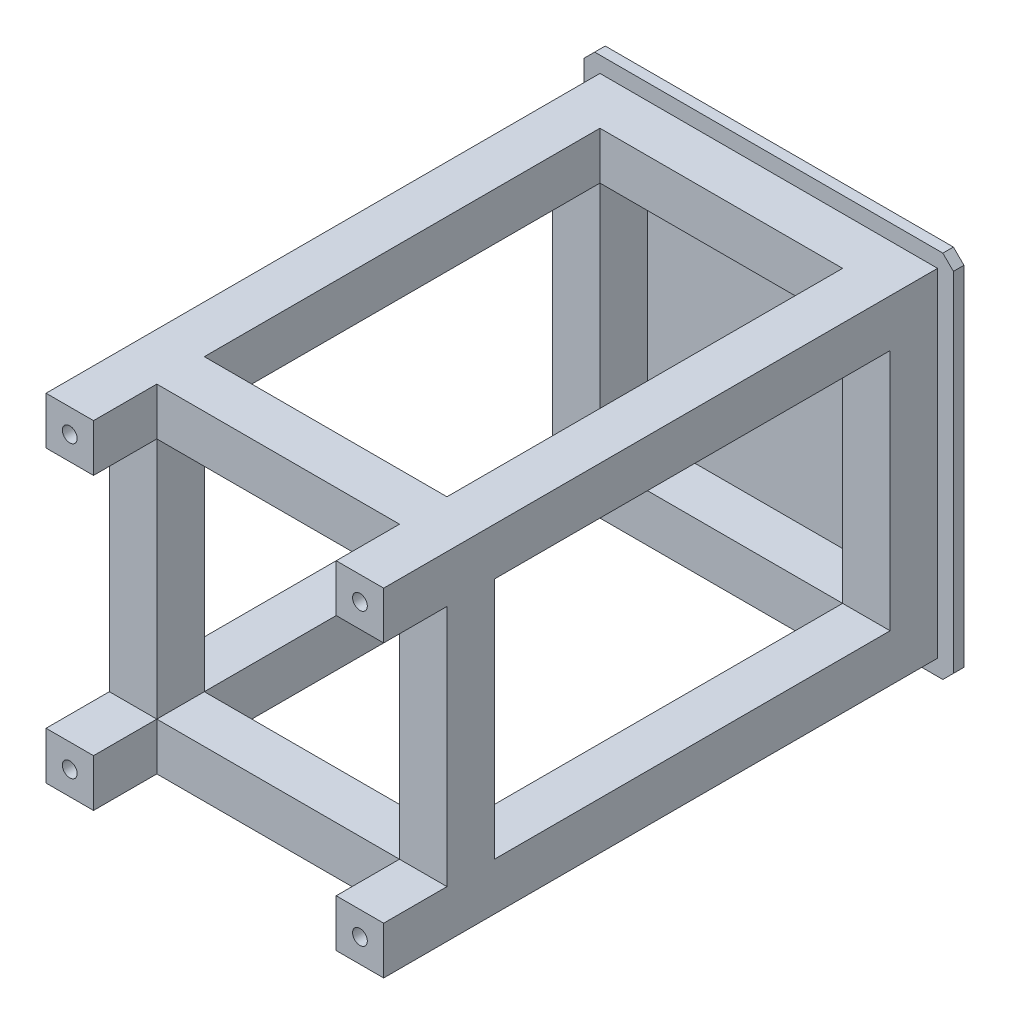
ISO-10303-21;
HEADER;
FILE_DESCRIPTION(('STEP AP214'),'2;1');
FILE_NAME('part.step','',(''),(''),'','','');
FILE_SCHEMA(('AUTOMOTIVE_DESIGN { 1 0 10303 214 1 1 1 1 }'));
ENDSEC;
DATA;
#1=APPLICATION_CONTEXT('core data for automotive mechanical design processes');
#2=APPLICATION_PROTOCOL_DEFINITION('international standard','automotive_design',2000,#1);
#3=PRODUCT_CONTEXT('',#1,'mechanical');
#4=PRODUCT('Part','Part','',(#3));
#5=PRODUCT_RELATED_PRODUCT_CATEGORY('part','',(#4));
#6=PRODUCT_DEFINITION_FORMATION('','',#4);
#7=PRODUCT_DEFINITION_CONTEXT('part definition',#1,'design');
#8=PRODUCT_DEFINITION('design','',#6,#7);
#9=PRODUCT_DEFINITION_SHAPE('','',#8);
#10=(LENGTH_UNIT() NAMED_UNIT(*) SI_UNIT(.MILLI.,.METRE.));
#11=(NAMED_UNIT(*) PLANE_ANGLE_UNIT() SI_UNIT($,.RADIAN.));
#12=(NAMED_UNIT(*) SI_UNIT($,.STERADIAN.) SOLID_ANGLE_UNIT());
#13=UNCERTAINTY_MEASURE_WITH_UNIT(LENGTH_MEASURE(1.E-05),#10,'distance_accuracy_value','');
#14=(GEOMETRIC_REPRESENTATION_CONTEXT(3) GLOBAL_UNCERTAINTY_ASSIGNED_CONTEXT((#13)) GLOBAL_UNIT_ASSIGNED_CONTEXT((#10,
#11,#12)) REPRESENTATION_CONTEXT('',''));
#15=CARTESIAN_POINT('',(0.,0.,0.));
#16=DIRECTION('',(0.,0.,1.));
#17=DIRECTION('',(1.,0.,0.));
#18=AXIS2_PLACEMENT_3D('',#15,#16,#17);
#19=CARTESIAN_POINT('',(-160.,115.,535.));
#20=DIRECTION('',(0.,1.,0.));
#21=DIRECTION('',(-1.,0.,0.));
#22=AXIS2_PLACEMENT_3D('',#19,#20,#21);
#23=PLANE('',#22);
#24=DIRECTION('',(-1.,0.,0.));
#25=VECTOR('',#24,1.);
#26=CARTESIAN_POINT('',(-160.,115.,475.));
#27=LINE('',#26,#25);
#28=CARTESIAN_POINT('',(-115.,115.,475.));
#29=VERTEX_POINT('',#28);
#30=CARTESIAN_POINT('',(-160.,115.,475.));
#31=VERTEX_POINT('',#30);
#32=EDGE_CURVE('E267',#29,#31,#27,.T.);
#33=ORIENTED_EDGE('',*,*,#32,.F.);
#34=DIRECTION('',(0.,0.,-1.));
#35=VECTOR('',#34,1.);
#36=CARTESIAN_POINT('',(-115.,115.,535.));
#37=LINE('',#36,#35);
#38=CARTESIAN_POINT('',(-115.,115.,535.));
#39=VERTEX_POINT('',#38);
#40=EDGE_CURVE('E340',#39,#29,#37,.T.);
#41=ORIENTED_EDGE('',*,*,#40,.F.);
#42=DIRECTION('',(1.,0.,0.));
#43=VECTOR('',#42,1.);
#44=CARTESIAN_POINT('',(-160.,115.,535.));
#45=LINE('',#44,#43);
#46=CARTESIAN_POINT('',(-160.,115.,535.));
#47=VERTEX_POINT('',#46);
#48=EDGE_CURVE('E329',#47,#39,#45,.T.);
#49=ORIENTED_EDGE('',*,*,#48,.F.);
#50=DIRECTION('',(0.,0.,-1.));
#51=VECTOR('',#50,1.);
#52=CARTESIAN_POINT('',(-160.,115.,535.));
#53=LINE('',#52,#51);
#54=EDGE_CURVE('E361',#47,#31,#53,.T.);
#55=ORIENTED_EDGE('',*,*,#54,.T.);
#56=EDGE_LOOP('',(#33,#41,#49,#55));
#57=FACE_BOUND('',#56,.T.);
#58=ADVANCED_FACE('F16',(#57),#23,.F.);
#59=DIRECTION('',(0.,0.,-1.));
#60=VECTOR('',#59,1.);
#61=CARTESIAN_POINT('',(-115.,115.,475.));
#62=LINE('',#61,#60);
#63=CARTESIAN_POINT('',(-115.,115.,430.));
#64=VERTEX_POINT('',#63);
#65=EDGE_CURVE('E550',#29,#64,#62,.T.);
#66=ORIENTED_EDGE('',*,*,#65,.T.);
#67=DIRECTION('',(1.,0.,0.));
#68=VECTOR('',#67,1.);
#69=CARTESIAN_POINT('',(-160.,115.,430.));
#70=LINE('',#69,#68);
#71=CARTESIAN_POINT('',(115.,115.,430.));
#72=VERTEX_POINT('',#71);
#73=EDGE_CURVE('E534',#64,#72,#70,.T.);
#74=ORIENTED_EDGE('',*,*,#73,.T.);
#75=DIRECTION('',(0.,0.,-1.));
#76=VECTOR('',#75,1.);
#77=CARTESIAN_POINT('',(115.,115.,475.));
#78=LINE('',#77,#76);
#79=CARTESIAN_POINT('',(115.,115.,475.));
#80=VERTEX_POINT('',#79);
#81=EDGE_CURVE('E589',#80,#72,#78,.T.);
#82=ORIENTED_EDGE('',*,*,#81,.F.);
#83=DIRECTION('',(1.,0.,0.));
#84=VECTOR('',#83,1.);
#85=CARTESIAN_POINT('',(-160.,115.,475.));
#86=LINE('',#85,#84);
#87=EDGE_CURVE('E613',#29,#80,#86,.T.);
#88=ORIENTED_EDGE('',*,*,#87,.F.);
#89=EDGE_LOOP('',(#66,#74,#82,#88));
#90=FACE_BOUND('',#89,.T.);
#91=ADVANCED_FACE('F478',(#90),#23,.F.);
#92=CARTESIAN_POINT('',(-160.,-115.,535.));
#93=DIRECTION('',(0.,-1.,0.));
#94=DIRECTION('',(1.,0.,0.));
#95=AXIS2_PLACEMENT_3D('',#92,#93,#94);
#96=PLANE('',#95);
#97=DIRECTION('',(1.,0.,0.));
#98=VECTOR('',#97,1.);
#99=CARTESIAN_POINT('',(-160.,-115.,475.));
#100=LINE('',#99,#98);
#101=CARTESIAN_POINT('',(-160.,-115.,475.));
#102=VERTEX_POINT('',#101);
#103=CARTESIAN_POINT('',(-115.,-115.,475.));
#104=VERTEX_POINT('',#103);
#105=EDGE_CURVE('E265',#102,#104,#100,.T.);
#106=ORIENTED_EDGE('',*,*,#105,.F.);
#107=DIRECTION('',(0.,0.,-1.));
#108=VECTOR('',#107,1.);
#109=CARTESIAN_POINT('',(-160.,-115.,535.));
#110=LINE('',#109,#108);
#111=CARTESIAN_POINT('',(-160.,-115.,535.));
#112=VERTEX_POINT('',#111);
#113=EDGE_CURVE('E277',#112,#102,#110,.T.);
#114=ORIENTED_EDGE('',*,*,#113,.F.);
#115=DIRECTION('',(-1.,0.,0.));
#116=VECTOR('',#115,1.);
#117=CARTESIAN_POINT('',(-160.,-115.,535.));
#118=LINE('',#117,#116);
#119=CARTESIAN_POINT('',(-115.,-115.,535.));
#120=VERTEX_POINT('',#119);
#121=EDGE_CURVE('E291',#120,#112,#118,.T.);
#122=ORIENTED_EDGE('',*,*,#121,.F.);
#123=DIRECTION('',(0.,0.,-1.));
#124=VECTOR('',#123,1.);
#125=CARTESIAN_POINT('',(-115.,-115.,535.));
#126=LINE('',#125,#124);
#127=EDGE_CURVE('E280',#120,#104,#126,.T.);
#128=ORIENTED_EDGE('',*,*,#127,.T.);
#129=EDGE_LOOP('',(#106,#114,#122,#128));
#130=FACE_BOUND('',#129,.T.);
#131=ADVANCED_FACE('F275',(#130),#96,.F.);
#132=DIRECTION('',(0.,0.,-1.));
#133=VECTOR('',#132,1.);
#134=CARTESIAN_POINT('',(-115.,-115.,475.));
#135=LINE('',#134,#133);
#136=CARTESIAN_POINT('',(-115.,-115.,430.));
#137=VERTEX_POINT('',#136);
#138=EDGE_CURVE('E552',#104,#137,#135,.T.);
#139=ORIENTED_EDGE('',*,*,#138,.F.);
#140=DIRECTION('',(-1.,0.,0.));
#141=VECTOR('',#140,1.);
#142=CARTESIAN_POINT('',(-160.,-115.,475.));
#143=LINE('',#142,#141);
#144=CARTESIAN_POINT('',(115.,-115.,475.));
#145=VERTEX_POINT('',#144);
#146=EDGE_CURVE('E596',#145,#104,#143,.T.);
#147=ORIENTED_EDGE('',*,*,#146,.F.);
#148=DIRECTION('',(0.,0.,-1.));
#149=VECTOR('',#148,1.);
#150=CARTESIAN_POINT('',(115.,-115.,475.));
#151=LINE('',#150,#149);
#152=CARTESIAN_POINT('',(115.,-115.,430.));
#153=VERTEX_POINT('',#152);
#154=EDGE_CURVE('E577',#145,#153,#151,.T.);
#155=ORIENTED_EDGE('',*,*,#154,.T.);
#156=DIRECTION('',(-1.,0.,0.));
#157=VECTOR('',#156,1.);
#158=CARTESIAN_POINT('',(-160.,-115.,430.));
#159=LINE('',#158,#157);
#160=EDGE_CURVE('E597',#153,#137,#159,.T.);
#161=ORIENTED_EDGE('',*,*,#160,.T.);
#162=EDGE_LOOP('',(#139,#147,#155,#161));
#163=FACE_BOUND('',#162,.T.);
#164=ADVANCED_FACE('F517',(#163),#96,.F.);
#165=DIRECTION('',(-1.,0.,0.));
#166=VECTOR('',#165,1.);
#167=CARTESIAN_POINT('',(160.,115.,475.));
#168=LINE('',#167,#166);
#169=CARTESIAN_POINT('',(160.,115.,475.));
#170=VERTEX_POINT('',#169);
#171=EDGE_CURVE('E570',#170,#80,#168,.T.);
#172=ORIENTED_EDGE('',*,*,#171,.F.);
#173=DIRECTION('',(0.,0.,-1.));
#174=VECTOR('',#173,1.);
#175=CARTESIAN_POINT('',(160.,115.,535.));
#176=LINE('',#175,#174);
#177=CARTESIAN_POINT('',(160.,115.,535.));
#178=VERTEX_POINT('',#177);
#179=EDGE_CURVE('E315',#178,#170,#176,.T.);
#180=ORIENTED_EDGE('',*,*,#179,.F.);
#181=DIRECTION('',(1.,0.,0.));
#182=VECTOR('',#181,1.);
#183=CARTESIAN_POINT('',(160.,115.,535.));
#184=LINE('',#183,#182);
#185=CARTESIAN_POINT('',(115.,115.,535.));
#186=VERTEX_POINT('',#185);
#187=EDGE_CURVE('E308',#186,#178,#184,.T.);
#188=ORIENTED_EDGE('',*,*,#187,.F.);
#189=DIRECTION('',(0.,0.,-1.));
#190=VECTOR('',#189,1.);
#191=CARTESIAN_POINT('',(115.,115.,535.));
#192=LINE('',#191,#190);
#193=EDGE_CURVE('E319',#186,#80,#192,.T.);
#194=ORIENTED_EDGE('',*,*,#193,.T.);
#195=EDGE_LOOP('',(#172,#180,#188,#194));
#196=FACE_BOUND('',#195,.T.);
#197=ADVANCED_FACE('F487',(#196),#23,.F.);
#198=CARTESIAN_POINT('',(-115.,115.,55.));
#199=VERTEX_POINT('',#198);
#200=EDGE_CURVE('E351',#64,#199,#37,.T.);
#201=ORIENTED_EDGE('',*,*,#200,.F.);
#202=DIRECTION('',(-1.,0.,0.));
#203=VECTOR('',#202,1.);
#204=CARTESIAN_POINT('',(-160.,115.,430.));
#205=LINE('',#204,#203);
#206=CARTESIAN_POINT('',(-160.,115.,430.));
#207=VERTEX_POINT('',#206);
#208=EDGE_CURVE('E524',#64,#207,#205,.T.);
#209=ORIENTED_EDGE('',*,*,#208,.T.);
#210=CARTESIAN_POINT('',(-160.,115.,55.));
#211=VERTEX_POINT('',#210);
#212=EDGE_CURVE('E359',#207,#211,#53,.T.);
#213=ORIENTED_EDGE('',*,*,#212,.T.);
#214=DIRECTION('',(1.,0.,0.));
#215=VECTOR('',#214,1.);
#216=CARTESIAN_POINT('',(-160.,115.,55.));
#217=LINE('',#216,#215);
#218=EDGE_CURVE('E325',#211,#199,#217,.T.);
#219=ORIENTED_EDGE('',*,*,#218,.T.);
#220=EDGE_LOOP('',(#201,#209,#213,#219));
#221=FACE_BOUND('',#220,.T.);
#222=ADVANCED_FACE('F494',(#221),#23,.F.);
#223=DIRECTION('',(1.,0.,0.));
#224=VECTOR('',#223,1.);
#225=CARTESIAN_POINT('',(160.,-115.,475.));
#226=LINE('',#225,#224);
#227=CARTESIAN_POINT('',(160.,-115.,475.));
#228=VERTEX_POINT('',#227);
#229=EDGE_CURVE('E575',#145,#228,#226,.T.);
#230=ORIENTED_EDGE('',*,*,#229,.F.);
#231=DIRECTION('',(0.,0.,-1.));
#232=VECTOR('',#231,1.);
#233=CARTESIAN_POINT('',(115.,-115.,535.));
#234=LINE('',#233,#232);
#235=CARTESIAN_POINT('',(115.,-115.,535.));
#236=VERTEX_POINT('',#235);
#237=EDGE_CURVE('E668',#236,#145,#234,.T.);
#238=ORIENTED_EDGE('',*,*,#237,.F.);
#239=DIRECTION('',(-1.,0.,0.));
#240=VECTOR('',#239,1.);
#241=CARTESIAN_POINT('',(115.,-115.,535.));
#242=LINE('',#241,#240);
#243=CARTESIAN_POINT('',(160.,-115.,535.));
#244=VERTEX_POINT('',#243);
#245=EDGE_CURVE('E661',#244,#236,#242,.T.);
#246=ORIENTED_EDGE('',*,*,#245,.F.);
#247=DIRECTION('',(0.,0.,-1.));
#248=VECTOR('',#247,1.);
#249=CARTESIAN_POINT('',(160.,-115.,535.));
#250=LINE('',#249,#248);
#251=EDGE_CURVE('E672',#244,#228,#250,.T.);
#252=ORIENTED_EDGE('',*,*,#251,.T.);
#253=EDGE_LOOP('',(#230,#238,#246,#252));
#254=FACE_BOUND('',#253,.T.);
#255=ADVANCED_FACE('F507',(#254),#96,.F.);
#256=CARTESIAN_POINT('',(-160.,-115.,430.));
#257=VERTEX_POINT('',#256);
#258=CARTESIAN_POINT('',(-160.,-115.,55.));
#259=VERTEX_POINT('',#258);
#260=EDGE_CURVE('E288',#257,#259,#110,.T.);
#261=ORIENTED_EDGE('',*,*,#260,.F.);
#262=DIRECTION('',(1.,0.,0.));
#263=VECTOR('',#262,1.);
#264=CARTESIAN_POINT('',(-160.,-115.,430.));
#265=LINE('',#264,#263);
#266=EDGE_CURVE('E555',#257,#137,#265,.T.);
#267=ORIENTED_EDGE('',*,*,#266,.T.);
#268=CARTESIAN_POINT('',(-115.,-115.,55.));
#269=VERTEX_POINT('',#268);
#270=EDGE_CURVE('E287',#137,#269,#126,.T.);
#271=ORIENTED_EDGE('',*,*,#270,.T.);
#272=DIRECTION('',(-1.,0.,0.));
#273=VECTOR('',#272,1.);
#274=CARTESIAN_POINT('',(-160.,-115.,55.));
#275=LINE('',#274,#273);
#276=EDGE_CURVE('E293',#269,#259,#275,.T.);
#277=ORIENTED_EDGE('',*,*,#276,.T.);
#278=EDGE_LOOP('',(#261,#267,#271,#277));
#279=FACE_BOUND('',#278,.T.);
#280=ADVANCED_FACE('F514',(#279),#96,.F.);
#281=CARTESIAN_POINT('',(-115.,-160.,535.));
#282=DIRECTION('',(-1.,0.,0.));
#283=DIRECTION('',(0.,0.,1.));
#284=AXIS2_PLACEMENT_3D('',#281,#282,#283);
#285=PLANE('',#284);
#286=DIRECTION('',(0.,1.,0.));
#287=VECTOR('',#286,1.);
#288=CARTESIAN_POINT('',(-115.,-160.,430.));
#289=LINE('',#288,#287);
#290=CARTESIAN_POINT('',(-115.,-160.,430.));
#291=VERTEX_POINT('',#290);
#292=EDGE_CURVE('E543',#291,#137,#289,.T.);
#293=ORIENTED_EDGE('',*,*,#292,.F.);
#294=DIRECTION('',(0.,0.,-1.));
#295=VECTOR('',#294,1.);
#296=CARTESIAN_POINT('',(-115.,-160.,535.));
#297=LINE('',#296,#295);
#298=CARTESIAN_POINT('',(-115.,-160.,55.));
#299=VERTEX_POINT('',#298);
#300=EDGE_CURVE('E296',#291,#299,#297,.T.);
#301=ORIENTED_EDGE('',*,*,#300,.T.);
#302=DIRECTION('',(0.,1.,0.));
#303=VECTOR('',#302,1.);
#304=CARTESIAN_POINT('',(-115.,-160.,55.));
#305=LINE('',#304,#303);
#306=EDGE_CURVE('E679',#299,#269,#305,.T.);
#307=ORIENTED_EDGE('',*,*,#306,.T.);
#308=ORIENTED_EDGE('',*,*,#270,.F.);
#309=EDGE_LOOP('',(#293,#301,#307,#308));
#310=FACE_BOUND('',#309,.T.);
#311=ADVANCED_FACE('F792',(#310),#285,.F.);
#312=CARTESIAN_POINT('',(115.,-115.,535.));
#313=DIRECTION('',(1.,0.,0.));
#314=DIRECTION('',(0.,0.,-1.));
#315=AXIS2_PLACEMENT_3D('',#312,#313,#314);
#316=PLANE('',#315);
#317=DIRECTION('',(0.,-1.,0.));
#318=VECTOR('',#317,1.);
#319=CARTESIAN_POINT('',(115.,-115.,430.));
#320=LINE('',#319,#318);
#321=CARTESIAN_POINT('',(115.,-160.,430.));
#322=VERTEX_POINT('',#321);
#323=EDGE_CURVE('E608',#153,#322,#320,.T.);
#324=ORIENTED_EDGE('',*,*,#323,.F.);
#325=CARTESIAN_POINT('',(115.,-115.,55.));
#326=VERTEX_POINT('',#325);
#327=EDGE_CURVE('E663',#153,#326,#234,.T.);
#328=ORIENTED_EDGE('',*,*,#327,.T.);
#329=DIRECTION('',(0.,-1.,0.));
#330=VECTOR('',#329,1.);
#331=CARTESIAN_POINT('',(115.,-115.,55.));
#332=LINE('',#331,#330);
#333=CARTESIAN_POINT('',(115.,-160.,55.));
#334=VERTEX_POINT('',#333);
#335=EDGE_CURVE('E651',#326,#334,#332,.T.);
#336=ORIENTED_EDGE('',*,*,#335,.T.);
#337=DIRECTION('',(0.,0.,-1.));
#338=VECTOR('',#337,1.);
#339=CARTESIAN_POINT('',(115.,-160.,535.));
#340=LINE('',#339,#338);
#341=EDGE_CURVE('E675',#322,#334,#340,.T.);
#342=ORIENTED_EDGE('',*,*,#341,.F.);
#343=EDGE_LOOP('',(#324,#328,#336,#342));
#344=FACE_BOUND('',#343,.T.);
#345=ADVANCED_FACE('F795',(#344),#316,.F.);
#346=CARTESIAN_POINT('',(-115.,160.,535.));
#347=DIRECTION('',(-1.,0.,0.));
#348=DIRECTION('',(0.,-1.,0.));
#349=AXIS2_PLACEMENT_3D('',#346,#347,#348);
#350=PLANE('',#349);
#351=DIRECTION('',(0.,1.,0.));
#352=VECTOR('',#351,1.);
#353=CARTESIAN_POINT('',(-115.,160.,430.));
#354=LINE('',#353,#352);
#355=CARTESIAN_POINT('',(-115.,160.,430.));
#356=VERTEX_POINT('',#355);
#357=EDGE_CURVE('E538',#64,#356,#354,.T.);
#358=ORIENTED_EDGE('',*,*,#357,.F.);
#359=ORIENTED_EDGE('',*,*,#200,.T.);
#360=DIRECTION('',(0.,1.,0.));
#361=VECTOR('',#360,1.);
#362=CARTESIAN_POINT('',(-115.,160.,55.));
#363=LINE('',#362,#361);
#364=CARTESIAN_POINT('',(-115.,160.,55.));
#365=VERTEX_POINT('',#364);
#366=EDGE_CURVE('E330',#199,#365,#363,.T.);
#367=ORIENTED_EDGE('',*,*,#366,.T.);
#368=DIRECTION('',(0.,0.,-1.));
#369=VECTOR('',#368,1.);
#370=CARTESIAN_POINT('',(-115.,160.,535.));
#371=LINE('',#370,#369);
#372=EDGE_CURVE('E337',#356,#365,#371,.T.);
#373=ORIENTED_EDGE('',*,*,#372,.F.);
#374=EDGE_LOOP('',(#358,#359,#367,#373));
#375=FACE_BOUND('',#374,.T.);
#376=ADVANCED_FACE('F502',(#375),#350,.F.);
#377=CARTESIAN_POINT('',(115.,160.,535.));
#378=DIRECTION('',(1.,0.,0.));
#379=DIRECTION('',(0.,1.,0.));
#380=AXIS2_PLACEMENT_3D('',#377,#378,#379);
#381=PLANE('',#380);
#382=DIRECTION('',(0.,-1.,0.));
#383=VECTOR('',#382,1.);
#384=CARTESIAN_POINT('',(115.,160.,430.));
#385=LINE('',#384,#383);
#386=CARTESIAN_POINT('',(115.,160.,430.));
#387=VERTEX_POINT('',#386);
#388=EDGE_CURVE('E540',#387,#72,#385,.T.);
#389=ORIENTED_EDGE('',*,*,#388,.F.);
#390=DIRECTION('',(0.,0.,-1.));
#391=VECTOR('',#390,1.);
#392=CARTESIAN_POINT('',(115.,160.,535.));
#393=LINE('',#392,#391);
#394=CARTESIAN_POINT('',(115.,160.,55.));
#395=VERTEX_POINT('',#394);
#396=EDGE_CURVE('E322',#387,#395,#393,.T.);
#397=ORIENTED_EDGE('',*,*,#396,.T.);
#398=DIRECTION('',(0.,-1.,0.));
#399=VECTOR('',#398,1.);
#400=CARTESIAN_POINT('',(115.,160.,55.));
#401=LINE('',#400,#399);
#402=CARTESIAN_POINT('',(115.,115.,55.));
#403=VERTEX_POINT('',#402);
#404=EDGE_CURVE('E299',#395,#403,#401,.T.);
#405=ORIENTED_EDGE('',*,*,#404,.T.);
#406=EDGE_CURVE('E318',#72,#403,#192,.T.);
#407=ORIENTED_EDGE('',*,*,#406,.F.);
#408=EDGE_LOOP('',(#389,#397,#405,#407));
#409=FACE_BOUND('',#408,.T.);
#410=ADVANCED_FACE('F929',(#409),#381,.F.);
#411=CARTESIAN_POINT('',(0.,0.,55.));
#412=DIRECTION('',(0.,0.,1.));
#413=DIRECTION('',(1.,0.,0.));
#414=AXIS2_PLACEMENT_3D('',#411,#412,#413);
#415=PLANE('',#414);
#416=DIRECTION('',(1.,0.,0.));
#417=VECTOR('',#416,1.);
#418=CARTESIAN_POINT('',(-160.,-160.,55.));
#419=LINE('',#418,#417);
#420=EDGE_CURVE('E724',#299,#334,#419,.T.);
#421=ORIENTED_EDGE('',*,*,#420,.T.);
#422=ORIENTED_EDGE('',*,*,#335,.F.);
#423=DIRECTION('',(-1.,0.,0.));
#424=VECTOR('',#423,1.);
#425=CARTESIAN_POINT('',(-160.,-115.,55.));
#426=LINE('',#425,#424);
#427=EDGE_CURVE('E713',#326,#269,#426,.T.);
#428=ORIENTED_EDGE('',*,*,#427,.T.);
#429=ORIENTED_EDGE('',*,*,#306,.F.);
#430=EDGE_LOOP('',(#421,#422,#428,#429));
#431=FACE_BOUND('',#430,.T.);
#432=ADVANCED_FACE('F721',(#431),#415,.T.);
#433=DIRECTION('',(0.,-1.,0.));
#434=VECTOR('',#433,1.);
#435=CARTESIAN_POINT('',(115.,115.,55.));
#436=LINE('',#435,#434);
#437=EDGE_CURVE('E741',#403,#326,#436,.T.);
#438=ORIENTED_EDGE('',*,*,#437,.T.);
#439=DIRECTION('',(-1.,0.,0.));
#440=VECTOR('',#439,1.);
#441=CARTESIAN_POINT('',(115.,-115.,55.));
#442=LINE('',#441,#440);
#443=CARTESIAN_POINT('',(160.,-115.,55.));
#444=VERTEX_POINT('',#443);
#445=EDGE_CURVE('E656',#444,#326,#442,.T.);
#446=ORIENTED_EDGE('',*,*,#445,.F.);
#447=DIRECTION('',(0.,1.,0.));
#448=VECTOR('',#447,1.);
#449=CARTESIAN_POINT('',(160.,160.,55.));
#450=LINE('',#449,#448);
#451=CARTESIAN_POINT('',(160.,115.,55.));
#452=VERTEX_POINT('',#451);
#453=EDGE_CURVE('E428',#444,#452,#450,.T.);
#454=ORIENTED_EDGE('',*,*,#453,.T.);
#455=DIRECTION('',(1.,0.,0.));
#456=VECTOR('',#455,1.);
#457=CARTESIAN_POINT('',(160.,115.,55.));
#458=LINE('',#457,#456);
#459=EDGE_CURVE('E304',#403,#452,#458,.T.);
#460=ORIENTED_EDGE('',*,*,#459,.F.);
#461=EDGE_LOOP('',(#438,#446,#454,#460));
#462=FACE_BOUND('',#461,.T.);
#463=ADVANCED_FACE('F804',(#462),#415,.T.);
#464=DIRECTION('',(0.,-1.,0.));
#465=VECTOR('',#464,1.);
#466=CARTESIAN_POINT('',(-160.,160.,55.));
#467=LINE('',#466,#465);
#468=EDGE_CURVE('E414',#211,#259,#467,.T.);
#469=ORIENTED_EDGE('',*,*,#468,.T.);
#470=ORIENTED_EDGE('',*,*,#276,.F.);
#471=DIRECTION('',(0.,1.,0.));
#472=VECTOR('',#471,1.);
#473=CARTESIAN_POINT('',(-115.,115.,55.));
#474=LINE('',#473,#472);
#475=EDGE_CURVE('E697',#269,#199,#474,.T.);
#476=ORIENTED_EDGE('',*,*,#475,.T.);
#477=ORIENTED_EDGE('',*,*,#218,.F.);
#478=EDGE_LOOP('',(#469,#470,#476,#477));
#479=FACE_BOUND('',#478,.T.);
#480=ADVANCED_FACE('F696',(#479),#415,.T.);
#481=DIRECTION('',(1.,0.,0.));
#482=VECTOR('',#481,1.);
#483=CARTESIAN_POINT('',(-160.,115.,55.));
#484=LINE('',#483,#482);
#485=EDGE_CURVE('E418',#199,#403,#484,.T.);
#486=ORIENTED_EDGE('',*,*,#485,.T.);
#487=ORIENTED_EDGE('',*,*,#404,.F.);
#488=DIRECTION('',(-1.,0.,0.));
#489=VECTOR('',#488,1.);
#490=CARTESIAN_POINT('',(-160.,160.,55.));
#491=LINE('',#490,#489);
#492=EDGE_CURVE('E354',#395,#365,#491,.T.);
#493=ORIENTED_EDGE('',*,*,#492,.T.);
#494=ORIENTED_EDGE('',*,*,#366,.F.);
#495=EDGE_LOOP('',(#486,#487,#493,#494));
#496=FACE_BOUND('',#495,.T.);
#497=ADVANCED_FACE('F812',(#496),#415,.T.);
#498=CARTESIAN_POINT('',(0.,0.,10.));
#499=DIRECTION('',(0.,0.,1.));
#500=DIRECTION('',(1.,0.,0.));
#501=AXIS2_PLACEMENT_3D('',#498,#499,#500);
#502=PLANE('',#501);
#503=DIRECTION('',(0.,1.,0.));
#504=VECTOR('',#503,1.);
#505=CARTESIAN_POINT('',(175.,175.,10.));
#506=LINE('',#505,#504);
#507=CARTESIAN_POINT('',(175.,-165.,10.));
#508=VERTEX_POINT('',#507);
#509=CARTESIAN_POINT('',(175.,165.,10.));
#510=VERTEX_POINT('',#509);
#511=EDGE_CURVE('E404',#508,#510,#506,.T.);
#512=ORIENTED_EDGE('',*,*,#511,.T.);
#513=DIRECTION('',(0.707106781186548,-0.707106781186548,0.));
#514=VECTOR('',#513,1.);
#515=CARTESIAN_POINT('',(170.,170.,10.));
#516=LINE('',#515,#514);
#517=CARTESIAN_POINT('',(165.,175.,10.));
#518=VERTEX_POINT('',#517);
#519=EDGE_CURVE('E386',#510,#518,#516,.F.);
#520=ORIENTED_EDGE('',*,*,#519,.T.);
#521=DIRECTION('',(-1.,0.,0.));
#522=VECTOR('',#521,1.);
#523=CARTESIAN_POINT('',(-175.,175.,10.));
#524=LINE('',#523,#522);
#525=CARTESIAN_POINT('',(-165.,175.,10.));
#526=VERTEX_POINT('',#525);
#527=EDGE_CURVE('E408',#518,#526,#524,.T.);
#528=ORIENTED_EDGE('',*,*,#527,.T.);
#529=DIRECTION('',(0.707106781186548,0.707106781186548,0.));
#530=VECTOR('',#529,1.);
#531=CARTESIAN_POINT('',(-170.,170.,10.));
#532=LINE('',#531,#530);
#533=CARTESIAN_POINT('',(-175.,165.,10.));
#534=VERTEX_POINT('',#533);
#535=EDGE_CURVE('E384',#526,#534,#532,.F.);
#536=ORIENTED_EDGE('',*,*,#535,.T.);
#537=DIRECTION('',(0.,-1.,0.));
#538=VECTOR('',#537,1.);
#539=CARTESIAN_POINT('',(-175.,175.,10.));
#540=LINE('',#539,#538);
#541=CARTESIAN_POINT('',(-175.,-165.,10.));
#542=VERTEX_POINT('',#541);
#543=EDGE_CURVE('E449',#534,#542,#540,.T.);
#544=ORIENTED_EDGE('',*,*,#543,.T.);
#545=DIRECTION('',(-0.707106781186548,0.707106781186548,0.));
#546=VECTOR('',#545,1.);
#547=CARTESIAN_POINT('',(-170.,-170.,10.));
#548=LINE('',#547,#546);
#549=CARTESIAN_POINT('',(-165.,-175.,10.));
#550=VERTEX_POINT('',#549);
#551=EDGE_CURVE('E36',#542,#550,#548,.F.);
#552=ORIENTED_EDGE('',*,*,#551,.T.);
#553=DIRECTION('',(1.,0.,0.));
#554=VECTOR('',#553,1.);
#555=CARTESIAN_POINT('',(-175.,-175.,10.));
#556=LINE('',#555,#554);
#557=CARTESIAN_POINT('',(165.,-175.,10.));
#558=VERTEX_POINT('',#557);
#559=EDGE_CURVE('E365',#550,#558,#556,.T.);
#560=ORIENTED_EDGE('',*,*,#559,.T.);
#561=DIRECTION('',(-0.707106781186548,-0.707106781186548,0.));
#562=VECTOR('',#561,1.);
#563=CARTESIAN_POINT('',(170.,-170.,10.));
#564=LINE('',#563,#562);
#565=EDGE_CURVE('E382',#558,#508,#564,.F.);
#566=ORIENTED_EDGE('',*,*,#565,.T.);
#567=EDGE_LOOP('',(#512,#520,#528,#536,#544,#552,#560,#566));
#568=FACE_BOUND('',#567,.T.);
#569=DIRECTION('',(1.,0.,0.));
#570=VECTOR('',#569,1.);
#571=CARTESIAN_POINT('',(-160.,-160.,10.));
#572=LINE('',#571,#570);
#573=CARTESIAN_POINT('',(-160.,-160.,10.));
#574=VERTEX_POINT('',#573);
#575=CARTESIAN_POINT('',(160.,-160.,10.));
#576=VERTEX_POINT('',#575);
#577=EDGE_CURVE('E729',#574,#576,#572,.T.);
#578=ORIENTED_EDGE('',*,*,#577,.F.);
#579=DIRECTION('',(0.,-1.,0.));
#580=VECTOR('',#579,1.);
#581=CARTESIAN_POINT('',(-160.,160.,10.));
#582=LINE('',#581,#580);
#583=CARTESIAN_POINT('',(-160.,160.,10.));
#584=VERTEX_POINT('',#583);
#585=EDGE_CURVE('E432',#584,#574,#582,.T.);
#586=ORIENTED_EDGE('',*,*,#585,.F.);
#587=DIRECTION('',(-1.,0.,0.));
#588=VECTOR('',#587,1.);
#589=CARTESIAN_POINT('',(-160.,160.,10.));
#590=LINE('',#589,#588);
#591=CARTESIAN_POINT('',(160.,160.,10.));
#592=VERTEX_POINT('',#591);
#593=EDGE_CURVE('E419',#592,#584,#590,.T.);
#594=ORIENTED_EDGE('',*,*,#593,.F.);
#595=DIRECTION('',(0.,1.,0.));
#596=VECTOR('',#595,1.);
#597=CARTESIAN_POINT('',(160.,160.,10.));
#598=LINE('',#597,#596);
#599=EDGE_CURVE('E437',#576,#592,#598,.T.);
#600=ORIENTED_EDGE('',*,*,#599,.F.);
#601=EDGE_LOOP('',(#578,#586,#594,#600));
#602=FACE_BOUND('',#601,.T.);
#603=ADVANCED_FACE('F464',(#568,#602),#502,.T.);
#604=DIRECTION('',(1.,0.,0.));
#605=VECTOR('',#604,1.);
#606=CARTESIAN_POINT('',(-160.,115.,10.));
#607=LINE('',#606,#605);
#608=CARTESIAN_POINT('',(-115.,115.,10.));
#609=VERTEX_POINT('',#608);
#610=CARTESIAN_POINT('',(115.,115.,10.));
#611=VERTEX_POINT('',#610);
#612=EDGE_CURVE('E435',#609,#611,#607,.T.);
#613=ORIENTED_EDGE('',*,*,#612,.F.);
#614=DIRECTION('',(0.,1.,0.));
#615=VECTOR('',#614,1.);
#616=CARTESIAN_POINT('',(-115.,115.,10.));
#617=LINE('',#616,#615);
#618=CARTESIAN_POINT('',(-115.,-115.,10.));
#619=VERTEX_POINT('',#618);
#620=EDGE_CURVE('E706',#619,#609,#617,.T.);
#621=ORIENTED_EDGE('',*,*,#620,.F.);
#622=DIRECTION('',(-1.,0.,0.));
#623=VECTOR('',#622,1.);
#624=CARTESIAN_POINT('',(-160.,-115.,10.));
#625=LINE('',#624,#623);
#626=CARTESIAN_POINT('',(115.,-115.,10.));
#627=VERTEX_POINT('',#626);
#628=EDGE_CURVE('E715',#627,#619,#625,.T.);
#629=ORIENTED_EDGE('',*,*,#628,.F.);
#630=DIRECTION('',(0.,-1.,0.));
#631=VECTOR('',#630,1.);
#632=CARTESIAN_POINT('',(115.,115.,10.));
#633=LINE('',#632,#631);
#634=EDGE_CURVE('E716',#611,#627,#633,.T.);
#635=ORIENTED_EDGE('',*,*,#634,.F.);
#636=EDGE_LOOP('',(#613,#621,#629,#635));
#637=FACE_BOUND('',#636,.T.);
#638=ADVANCED_FACE('F819',(#637),#502,.T.);
#639=CARTESIAN_POINT('',(-160.,115.,55.));
#640=DIRECTION('',(0.,1.,0.));
#641=DIRECTION('',(0.,0.,1.));
#642=AXIS2_PLACEMENT_3D('',#639,#640,#641);
#643=PLANE('',#642);
#644=DIRECTION('',(0.,0.,-1.));
#645=VECTOR('',#644,1.);
#646=CARTESIAN_POINT('',(-115.,115.,55.));
#647=LINE('',#646,#645);
#648=EDGE_CURVE('E705',#199,#609,#647,.T.);
#649=ORIENTED_EDGE('',*,*,#648,.T.);
#650=ORIENTED_EDGE('',*,*,#612,.T.);
#651=DIRECTION('',(0.,0.,-1.));
#652=VECTOR('',#651,1.);
#653=CARTESIAN_POINT('',(115.,115.,55.));
#654=LINE('',#653,#652);
#655=EDGE_CURVE('E732',#403,#611,#654,.T.);
#656=ORIENTED_EDGE('',*,*,#655,.F.);
#657=ORIENTED_EDGE('',*,*,#485,.F.);
#658=EDGE_LOOP('',(#649,#650,#656,#657));
#659=FACE_BOUND('',#658,.T.);
#660=ADVANCED_FACE('F816',(#659),#643,.F.);
#661=CARTESIAN_POINT('',(-160.,-115.,55.));
#662=DIRECTION('',(0.,-1.,0.));
#663=DIRECTION('',(0.,0.,-1.));
#664=AXIS2_PLACEMENT_3D('',#661,#662,#663);
#665=PLANE('',#664);
#666=DIRECTION('',(0.,0.,-1.));
#667=VECTOR('',#666,1.);
#668=CARTESIAN_POINT('',(-115.,-115.,55.));
#669=LINE('',#668,#667);
#670=EDGE_CURVE('E702',#269,#619,#669,.T.);
#671=ORIENTED_EDGE('',*,*,#670,.F.);
#672=ORIENTED_EDGE('',*,*,#427,.F.);
#673=DIRECTION('',(0.,0.,-1.));
#674=VECTOR('',#673,1.);
#675=CARTESIAN_POINT('',(115.,-115.,55.));
#676=LINE('',#675,#674);
#677=EDGE_CURVE('E736',#326,#627,#676,.T.);
#678=ORIENTED_EDGE('',*,*,#677,.T.);
#679=ORIENTED_EDGE('',*,*,#628,.T.);
#680=EDGE_LOOP('',(#671,#672,#678,#679));
#681=FACE_BOUND('',#680,.T.);
#682=ADVANCED_FACE('F711',(#681),#665,.F.);
#683=CARTESIAN_POINT('',(175.,175.,10.));
#684=DIRECTION('',(-1.,0.,0.));
#685=DIRECTION('',(0.,-1.,0.));
#686=AXIS2_PLACEMENT_3D('',#683,#684,#685);
#687=PLANE('',#686);
#688=DIRECTION('',(0.,1.,0.));
#689=VECTOR('',#688,1.);
#690=CARTESIAN_POINT('',(175.,175.,0.));
#691=LINE('',#690,#689);
#692=CARTESIAN_POINT('',(175.,-165.,0.));
#693=VERTEX_POINT('',#692);
#694=CARTESIAN_POINT('',(175.,165.,0.));
#695=VERTEX_POINT('',#694);
#696=EDGE_CURVE('E445',#693,#695,#691,.T.);
#697=ORIENTED_EDGE('',*,*,#696,.T.);
#698=DIRECTION('',(0.,0.,1.));
#699=VECTOR('',#698,1.);
#700=CARTESIAN_POINT('',(175.,165.,10.));
#701=LINE('',#700,#699);
#702=EDGE_CURVE('E379',#695,#510,#701,.T.);
#703=ORIENTED_EDGE('',*,*,#702,.T.);
#704=ORIENTED_EDGE('',*,*,#511,.F.);
#705=DIRECTION('',(0.,0.,-1.));
#706=VECTOR('',#705,1.);
#707=CARTESIAN_POINT('',(175.,-165.,10.));
#708=LINE('',#707,#706);
#709=EDGE_CURVE('E376',#508,#693,#708,.T.);
#710=ORIENTED_EDGE('',*,*,#709,.T.);
#711=EDGE_LOOP('',(#697,#703,#704,#710));
#712=FACE_BOUND('',#711,.T.);
#713=ADVANCED_FACE('F838',(#712),#687,.F.);
#714=CARTESIAN_POINT('',(-175.,175.,10.));
#715=DIRECTION('',(0.,-1.,0.));
#716=DIRECTION('',(0.,0.,-1.));
#717=AXIS2_PLACEMENT_3D('',#714,#715,#716);
#718=PLANE('',#717);
#719=ORIENTED_EDGE('',*,*,#527,.F.);
#720=DIRECTION('',(0.,0.,-1.));
#721=VECTOR('',#720,1.);
#722=CARTESIAN_POINT('',(165.,175.,10.));
#723=LINE('',#722,#721);
#724=CARTESIAN_POINT('',(165.,175.,0.));
#725=VERTEX_POINT('',#724);
#726=EDGE_CURVE('E364',#518,#725,#723,.T.);
#727=ORIENTED_EDGE('',*,*,#726,.T.);
#728=DIRECTION('',(-1.,0.,0.));
#729=VECTOR('',#728,1.);
#730=CARTESIAN_POINT('',(-175.,175.,0.));
#731=LINE('',#730,#729);
#732=CARTESIAN_POINT('',(-165.,175.,0.));
#733=VERTEX_POINT('',#732);
#734=EDGE_CURVE('E410',#725,#733,#731,.T.);
#735=ORIENTED_EDGE('',*,*,#734,.T.);
#736=DIRECTION('',(0.,0.,1.));
#737=VECTOR('',#736,1.);
#738=CARTESIAN_POINT('',(-165.,175.,10.));
#739=LINE('',#738,#737);
#740=EDGE_CURVE('E362',#733,#526,#739,.T.);
#741=ORIENTED_EDGE('',*,*,#740,.T.);
#742=EDGE_LOOP('',(#719,#727,#735,#741));
#743=FACE_BOUND('',#742,.T.);
#744=ADVANCED_FACE('F457',(#743),#718,.F.);
#745=CARTESIAN_POINT('',(-175.,175.,10.));
#746=DIRECTION('',(1.,0.,0.));
#747=DIRECTION('',(0.,1.,0.));
#748=AXIS2_PLACEMENT_3D('',#745,#746,#747);
#749=PLANE('',#748);
#750=ORIENTED_EDGE('',*,*,#543,.F.);
#751=DIRECTION('',(0.,0.,-1.));
#752=VECTOR('',#751,1.);
#753=CARTESIAN_POINT('',(-175.,165.,10.));
#754=LINE('',#753,#752);
#755=CARTESIAN_POINT('',(-175.,165.,0.));
#756=VERTEX_POINT('',#755);
#757=EDGE_CURVE('E390',#534,#756,#754,.T.);
#758=ORIENTED_EDGE('',*,*,#757,.T.);
#759=DIRECTION('',(0.,-1.,0.));
#760=VECTOR('',#759,1.);
#761=CARTESIAN_POINT('',(-175.,175.,0.));
#762=LINE('',#761,#760);
#763=CARTESIAN_POINT('',(-175.,-165.,0.));
#764=VERTEX_POINT('',#763);
#765=EDGE_CURVE('E405',#756,#764,#762,.T.);
#766=ORIENTED_EDGE('',*,*,#765,.T.);
#767=DIRECTION('',(0.,0.,1.));
#768=VECTOR('',#767,1.);
#769=CARTESIAN_POINT('',(-175.,-165.,10.));
#770=LINE('',#769,#768);
#771=EDGE_CURVE('E388',#764,#542,#770,.T.);
#772=ORIENTED_EDGE('',*,*,#771,.T.);
#773=EDGE_LOOP('',(#750,#758,#766,#772));
#774=FACE_BOUND('',#773,.T.);
#775=ADVANCED_FACE('F467',(#774),#749,.F.);
#776=CARTESIAN_POINT('',(-175.,-175.,10.));
#777=DIRECTION('',(0.,1.,0.));
#778=DIRECTION('',(0.,0.,1.));
#779=AXIS2_PLACEMENT_3D('',#776,#777,#778);
#780=PLANE('',#779);
#781=DIRECTION('',(1.,0.,0.));
#782=VECTOR('',#781,1.);
#783=CARTESIAN_POINT('',(-175.,-175.,0.));
#784=LINE('',#783,#782);
#785=CARTESIAN_POINT('',(-165.,-175.,0.));
#786=VERTEX_POINT('',#785);
#787=CARTESIAN_POINT('',(165.,-175.,0.));
#788=VERTEX_POINT('',#787);
#789=EDGE_CURVE('E396',#786,#788,#784,.T.);
#790=ORIENTED_EDGE('',*,*,#789,.T.);
#791=DIRECTION('',(0.,0.,1.));
#792=VECTOR('',#791,1.);
#793=CARTESIAN_POINT('',(165.,-175.,10.));
#794=LINE('',#793,#792);
#795=EDGE_CURVE('E11',#788,#558,#794,.T.);
#796=ORIENTED_EDGE('',*,*,#795,.T.);
#797=ORIENTED_EDGE('',*,*,#559,.F.);
#798=DIRECTION('',(0.,0.,-1.));
#799=VECTOR('',#798,1.);
#800=CARTESIAN_POINT('',(-165.,-175.,10.));
#801=LINE('',#800,#799);
#802=EDGE_CURVE('E24',#550,#786,#801,.T.);
#803=ORIENTED_EDGE('',*,*,#802,.T.);
#804=EDGE_LOOP('',(#790,#796,#797,#803));
#805=FACE_BOUND('',#804,.T.);
#806=ADVANCED_FACE('F395',(#805),#780,.F.);
#807=CARTESIAN_POINT('',(0.,0.,0.));
#808=DIRECTION('',(0.,0.,1.));
#809=DIRECTION('',(1.,0.,0.));
#810=AXIS2_PLACEMENT_3D('',#807,#808,#809);
#811=PLANE('',#810);
#812=ORIENTED_EDGE('',*,*,#734,.F.);
#813=DIRECTION('',(-0.707106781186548,0.707106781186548,0.));
#814=VECTOR('',#813,1.);
#815=CARTESIAN_POINT('',(165.,175.,0.));
#816=LINE('',#815,#814);
#817=EDGE_CURVE('E374',#725,#695,#816,.F.);
#818=ORIENTED_EDGE('',*,*,#817,.T.);
#819=ORIENTED_EDGE('',*,*,#696,.F.);
#820=DIRECTION('',(0.707106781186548,0.707106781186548,0.));
#821=VECTOR('',#820,1.);
#822=CARTESIAN_POINT('',(175.,-165.,0.));
#823=LINE('',#822,#821);
#824=EDGE_CURVE('E370',#693,#788,#823,.F.);
#825=ORIENTED_EDGE('',*,*,#824,.T.);
#826=ORIENTED_EDGE('',*,*,#789,.F.);
#827=DIRECTION('',(0.707106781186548,-0.707106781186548,0.));
#828=VECTOR('',#827,1.);
#829=CARTESIAN_POINT('',(-165.,-175.,0.));
#830=LINE('',#829,#828);
#831=EDGE_CURVE('E368',#786,#764,#830,.F.);
#832=ORIENTED_EDGE('',*,*,#831,.T.);
#833=ORIENTED_EDGE('',*,*,#765,.F.);
#834=DIRECTION('',(-0.707106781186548,-0.707106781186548,0.));
#835=VECTOR('',#834,1.);
#836=CARTESIAN_POINT('',(-175.,165.,0.));
#837=LINE('',#836,#835);
#838=EDGE_CURVE('E372',#756,#733,#837,.F.);
#839=ORIENTED_EDGE('',*,*,#838,.T.);
#840=EDGE_LOOP('',(#812,#818,#819,#825,#826,#832,#833,#839));
#841=FACE_BOUND('',#840,.T.);
#842=ADVANCED_FACE('F400',(#841),#811,.F.);
#843=CARTESIAN_POINT('',(-160.,160.,55.));
#844=DIRECTION('',(1.,0.,0.));
#845=DIRECTION('',(0.,0.,-1.));
#846=AXIS2_PLACEMENT_3D('',#843,#844,#845);
#847=PLANE('',#846);
#848=ORIENTED_EDGE('',*,*,#212,.F.);
#849=DIRECTION('',(0.,-1.,0.));
#850=VECTOR('',#849,1.);
#851=CARTESIAN_POINT('',(-160.,115.,430.));
#852=LINE('',#851,#850);
#853=EDGE_CURVE('E559',#207,#257,#852,.T.);
#854=ORIENTED_EDGE('',*,*,#853,.T.);
#855=ORIENTED_EDGE('',*,*,#260,.T.);
#856=ORIENTED_EDGE('',*,*,#468,.F.);
#857=EDGE_LOOP('',(#848,#854,#855,#856));
#858=FACE_BOUND('',#857,.T.);
#859=ORIENTED_EDGE('',*,*,#113,.T.);
#860=DIRECTION('',(0.,-1.,0.));
#861=VECTOR('',#860,1.);
#862=CARTESIAN_POINT('',(-160.,115.,475.));
#863=LINE('',#862,#861);
#864=EDGE_CURVE('E261',#31,#102,#863,.T.);
#865=ORIENTED_EDGE('',*,*,#864,.F.);
#866=ORIENTED_EDGE('',*,*,#54,.F.);
#867=DIRECTION('',(0.,-1.,0.));
#868=VECTOR('',#867,1.);
#869=CARTESIAN_POINT('',(-160.,160.,535.));
#870=LINE('',#869,#868);
#871=CARTESIAN_POINT('',(-160.,160.,535.));
#872=VERTEX_POINT('',#871);
#873=EDGE_CURVE('E326',#872,#47,#870,.T.);
#874=ORIENTED_EDGE('',*,*,#873,.F.);
#875=DIRECTION('',(0.,0.,-1.));
#876=VECTOR('',#875,1.);
#877=CARTESIAN_POINT('',(-160.,160.,55.));
#878=LINE('',#877,#876);
#879=EDGE_CURVE('E442',#872,#584,#878,.T.);
#880=ORIENTED_EDGE('',*,*,#879,.T.);
#881=ORIENTED_EDGE('',*,*,#585,.T.);
#882=DIRECTION('',(0.,0.,-1.));
#883=VECTOR('',#882,1.);
#884=CARTESIAN_POINT('',(-160.,-160.,55.));
#885=LINE('',#884,#883);
#886=CARTESIAN_POINT('',(-160.,-160.,535.));
#887=VERTEX_POINT('',#886);
#888=EDGE_CURVE('E723',#887,#574,#885,.T.);
#889=ORIENTED_EDGE('',*,*,#888,.F.);
#890=DIRECTION('',(0.,-1.,0.));
#891=VECTOR('',#890,1.);
#892=CARTESIAN_POINT('',(-160.,-160.,535.));
#893=LINE('',#892,#891);
#894=EDGE_CURVE('E286',#112,#887,#893,.T.);
#895=ORIENTED_EDGE('',*,*,#894,.F.);
#896=EDGE_LOOP('',(#859,#865,#866,#874,#880,#881,#889,#895));
#897=FACE_BOUND('',#896,.T.);
#898=ADVANCED_FACE('F284',(#858,#897),#847,.F.);
#899=CARTESIAN_POINT('',(160.,160.,55.));
#900=DIRECTION('',(-1.,0.,0.));
#901=DIRECTION('',(0.,0.,1.));
#902=AXIS2_PLACEMENT_3D('',#899,#900,#901);
#903=PLANE('',#902);
#904=DIRECTION('',(0.,1.,0.));
#905=VECTOR('',#904,1.);
#906=CARTESIAN_POINT('',(160.,115.,430.));
#907=LINE('',#906,#905);
#908=CARTESIAN_POINT('',(160.,-115.,430.));
#909=VERTEX_POINT('',#908);
#910=CARTESIAN_POINT('',(160.,115.,430.));
#911=VERTEX_POINT('',#910);
#912=EDGE_CURVE('E567',#909,#911,#907,.T.);
#913=ORIENTED_EDGE('',*,*,#912,.T.);
#914=EDGE_CURVE('E310',#911,#452,#176,.T.);
#915=ORIENTED_EDGE('',*,*,#914,.T.);
#916=ORIENTED_EDGE('',*,*,#453,.F.);
#917=EDGE_CURVE('E671',#909,#444,#250,.T.);
#918=ORIENTED_EDGE('',*,*,#917,.F.);
#919=EDGE_LOOP('',(#913,#915,#916,#918));
#920=FACE_BOUND('',#919,.T.);
#921=DIRECTION('',(0.,0.,-1.));
#922=VECTOR('',#921,1.);
#923=CARTESIAN_POINT('',(160.,-160.,55.));
#924=LINE('',#923,#922);
#925=CARTESIAN_POINT('',(160.,-160.,535.));
#926=VERTEX_POINT('',#925);
#927=EDGE_CURVE('E424',#926,#576,#924,.T.);
#928=ORIENTED_EDGE('',*,*,#927,.T.);
#929=ORIENTED_EDGE('',*,*,#599,.T.);
#930=DIRECTION('',(0.,0.,-1.));
#931=VECTOR('',#930,1.);
#932=CARTESIAN_POINT('',(160.,160.,55.));
#933=LINE('',#932,#931);
#934=CARTESIAN_POINT('',(160.,160.,535.));
#935=VERTEX_POINT('',#934);
#936=EDGE_CURVE('E444',#935,#592,#933,.T.);
#937=ORIENTED_EDGE('',*,*,#936,.F.);
#938=DIRECTION('',(0.,1.,0.));
#939=VECTOR('',#938,1.);
#940=CARTESIAN_POINT('',(160.,160.,535.));
#941=LINE('',#940,#939);
#942=EDGE_CURVE('E300',#178,#935,#941,.T.);
#943=ORIENTED_EDGE('',*,*,#942,.F.);
#944=ORIENTED_EDGE('',*,*,#179,.T.);
#945=DIRECTION('',(0.,1.,0.));
#946=VECTOR('',#945,1.);
#947=CARTESIAN_POINT('',(160.,115.,475.));
#948=LINE('',#947,#946);
#949=EDGE_CURVE('E568',#228,#170,#948,.T.);
#950=ORIENTED_EDGE('',*,*,#949,.F.);
#951=ORIENTED_EDGE('',*,*,#251,.F.);
#952=DIRECTION('',(0.,1.,0.));
#953=VECTOR('',#952,1.);
#954=CARTESIAN_POINT('',(160.,-115.,535.));
#955=LINE('',#954,#953);
#956=EDGE_CURVE('E659',#926,#244,#955,.T.);
#957=ORIENTED_EDGE('',*,*,#956,.F.);
#958=EDGE_LOOP('',(#928,#929,#937,#943,#944,#950,#951,#957));
#959=FACE_BOUND('',#958,.T.);
#960=ADVANCED_FACE('F807',(#920,#959),#903,.F.);
#961=CARTESIAN_POINT('',(-160.,160.,55.));
#962=DIRECTION('',(0.,-1.,0.));
#963=DIRECTION('',(1.,0.,0.));
#964=AXIS2_PLACEMENT_3D('',#961,#962,#963);
#965=PLANE('',#964);
#966=CARTESIAN_POINT('',(-115.,160.,535.));
#967=VERTEX_POINT('',#966);
#968=CARTESIAN_POINT('',(-115.,160.,475.));
#969=VERTEX_POINT('',#968);
#970=EDGE_CURVE('E348',#967,#969,#371,.T.);
#971=ORIENTED_EDGE('',*,*,#970,.T.);
#972=DIRECTION('',(-1.,0.,0.));
#973=VECTOR('',#972,1.);
#974=CARTESIAN_POINT('',(-160.,160.,475.));
#975=LINE('',#974,#973);
#976=CARTESIAN_POINT('',(115.,160.,475.));
#977=VERTEX_POINT('',#976);
#978=EDGE_CURVE('E616',#977,#969,#975,.T.);
#979=ORIENTED_EDGE('',*,*,#978,.F.);
#980=CARTESIAN_POINT('',(115.,160.,535.));
#981=VERTEX_POINT('',#980);
#982=EDGE_CURVE('E323',#981,#977,#393,.T.);
#983=ORIENTED_EDGE('',*,*,#982,.F.);
#984=DIRECTION('',(-1.,0.,0.));
#985=VECTOR('',#984,1.);
#986=CARTESIAN_POINT('',(160.,160.,535.));
#987=LINE('',#986,#985);
#988=EDGE_CURVE('E303',#935,#981,#987,.T.);
#989=ORIENTED_EDGE('',*,*,#988,.F.);
#990=ORIENTED_EDGE('',*,*,#936,.T.);
#991=ORIENTED_EDGE('',*,*,#593,.T.);
#992=ORIENTED_EDGE('',*,*,#879,.F.);
#993=DIRECTION('',(-1.,0.,0.));
#994=VECTOR('',#993,1.);
#995=CARTESIAN_POINT('',(-160.,160.,535.));
#996=LINE('',#995,#994);
#997=EDGE_CURVE('E334',#967,#872,#996,.T.);
#998=ORIENTED_EDGE('',*,*,#997,.F.);
#999=EDGE_LOOP('',(#971,#979,#983,#989,#990,#991,#992,#998));
#1000=FACE_BOUND('',#999,.T.);
#1001=ORIENTED_EDGE('',*,*,#396,.F.);
#1002=DIRECTION('',(-1.,0.,0.));
#1003=VECTOR('',#1002,1.);
#1004=CARTESIAN_POINT('',(-160.,160.,430.));
#1005=LINE('',#1004,#1003);
#1006=EDGE_CURVE('E542',#387,#356,#1005,.T.);
#1007=ORIENTED_EDGE('',*,*,#1006,.T.);
#1008=ORIENTED_EDGE('',*,*,#372,.T.);
#1009=ORIENTED_EDGE('',*,*,#492,.F.);
#1010=EDGE_LOOP('',(#1001,#1007,#1008,#1009));
#1011=FACE_BOUND('',#1010,.T.);
#1012=ADVANCED_FACE('F757',(#1000,#1011),#965,.F.);
#1013=CARTESIAN_POINT('',(-160.,-160.,55.));
#1014=DIRECTION('',(0.,1.,0.));
#1015=DIRECTION('',(-1.,0.,0.));
#1016=AXIS2_PLACEMENT_3D('',#1013,#1014,#1015);
#1017=PLANE('',#1016);
#1018=CARTESIAN_POINT('',(115.,-160.,535.));
#1019=VERTEX_POINT('',#1018);
#1020=CARTESIAN_POINT('',(115.,-160.,475.));
#1021=VERTEX_POINT('',#1020);
#1022=EDGE_CURVE('E676',#1019,#1021,#340,.T.);
#1023=ORIENTED_EDGE('',*,*,#1022,.T.);
#1024=DIRECTION('',(1.,0.,0.));
#1025=VECTOR('',#1024,1.);
#1026=CARTESIAN_POINT('',(-160.,-160.,475.));
#1027=LINE('',#1026,#1025);
#1028=CARTESIAN_POINT('',(-115.,-160.,475.));
#1029=VERTEX_POINT('',#1028);
#1030=EDGE_CURVE('E593',#1029,#1021,#1027,.T.);
#1031=ORIENTED_EDGE('',*,*,#1030,.F.);
#1032=CARTESIAN_POINT('',(-115.,-160.,535.));
#1033=VERTEX_POINT('',#1032);
#1034=EDGE_CURVE('E297',#1033,#1029,#297,.T.);
#1035=ORIENTED_EDGE('',*,*,#1034,.F.);
#1036=DIRECTION('',(1.,0.,0.));
#1037=VECTOR('',#1036,1.);
#1038=CARTESIAN_POINT('',(-160.,-160.,535.));
#1039=LINE('',#1038,#1037);
#1040=EDGE_CURVE('E681',#887,#1033,#1039,.T.);
#1041=ORIENTED_EDGE('',*,*,#1040,.F.);
#1042=ORIENTED_EDGE('',*,*,#888,.T.);
#1043=ORIENTED_EDGE('',*,*,#577,.T.);
#1044=ORIENTED_EDGE('',*,*,#927,.F.);
#1045=DIRECTION('',(1.,0.,0.));
#1046=VECTOR('',#1045,1.);
#1047=CARTESIAN_POINT('',(115.,-160.,535.));
#1048=LINE('',#1047,#1046);
#1049=EDGE_CURVE('E655',#1019,#926,#1048,.T.);
#1050=ORIENTED_EDGE('',*,*,#1049,.F.);
#1051=EDGE_LOOP('',(#1023,#1031,#1035,#1041,#1042,#1043,#1044,#1050));
#1052=FACE_BOUND('',#1051,.T.);
#1053=ORIENTED_EDGE('',*,*,#300,.F.);
#1054=DIRECTION('',(1.,0.,0.));
#1055=VECTOR('',#1054,1.);
#1056=CARTESIAN_POINT('',(-160.,-160.,430.));
#1057=LINE('',#1056,#1055);
#1058=EDGE_CURVE('E592',#291,#322,#1057,.T.);
#1059=ORIENTED_EDGE('',*,*,#1058,.T.);
#1060=ORIENTED_EDGE('',*,*,#341,.T.);
#1061=ORIENTED_EDGE('',*,*,#420,.F.);
#1062=EDGE_LOOP('',(#1053,#1059,#1060,#1061));
#1063=FACE_BOUND('',#1062,.T.);
#1064=ADVANCED_FACE('F766',(#1052,#1063),#1017,.F.);
#1065=CARTESIAN_POINT('',(115.,115.,55.));
#1066=DIRECTION('',(1.,0.,0.));
#1067=DIRECTION('',(0.,1.,0.));
#1068=AXIS2_PLACEMENT_3D('',#1065,#1066,#1067);
#1069=PLANE('',#1068);
#1070=ORIENTED_EDGE('',*,*,#634,.T.);
#1071=ORIENTED_EDGE('',*,*,#677,.F.);
#1072=ORIENTED_EDGE('',*,*,#437,.F.);
#1073=ORIENTED_EDGE('',*,*,#655,.T.);
#1074=EDGE_LOOP('',(#1070,#1071,#1072,#1073));
#1075=FACE_BOUND('',#1074,.T.);
#1076=ADVANCED_FACE('F503',(#1075),#1069,.F.);
#1077=CARTESIAN_POINT('',(-115.,115.,55.));
#1078=DIRECTION('',(-1.,0.,0.));
#1079=DIRECTION('',(0.,0.,1.));
#1080=AXIS2_PLACEMENT_3D('',#1077,#1078,#1079);
#1081=PLANE('',#1080);
#1082=ORIENTED_EDGE('',*,*,#620,.T.);
#1083=ORIENTED_EDGE('',*,*,#648,.F.);
#1084=ORIENTED_EDGE('',*,*,#475,.F.);
#1085=ORIENTED_EDGE('',*,*,#670,.T.);
#1086=EDGE_LOOP('',(#1082,#1083,#1084,#1085));
#1087=FACE_BOUND('',#1086,.T.);
#1088=ADVANCED_FACE('F492',(#1087),#1081,.F.);
#1089=ORIENTED_EDGE('',*,*,#914,.F.);
#1090=DIRECTION('',(-1.,0.,0.));
#1091=VECTOR('',#1090,1.);
#1092=CARTESIAN_POINT('',(160.,115.,430.));
#1093=LINE('',#1092,#1091);
#1094=EDGE_CURVE('E580',#911,#72,#1093,.T.);
#1095=ORIENTED_EDGE('',*,*,#1094,.T.);
#1096=ORIENTED_EDGE('',*,*,#406,.T.);
#1097=ORIENTED_EDGE('',*,*,#459,.T.);
#1098=EDGE_LOOP('',(#1089,#1095,#1096,#1097));
#1099=FACE_BOUND('',#1098,.T.);
#1100=ADVANCED_FACE('F481',(#1099),#23,.F.);
#1101=ORIENTED_EDGE('',*,*,#40,.T.);
#1102=DIRECTION('',(0.,1.,0.));
#1103=VECTOR('',#1102,1.);
#1104=CARTESIAN_POINT('',(-115.,160.,475.));
#1105=LINE('',#1104,#1103);
#1106=EDGE_CURVE('E623',#29,#969,#1105,.T.);
#1107=ORIENTED_EDGE('',*,*,#1106,.T.);
#1108=ORIENTED_EDGE('',*,*,#970,.F.);
#1109=DIRECTION('',(0.,1.,0.));
#1110=VECTOR('',#1109,1.);
#1111=CARTESIAN_POINT('',(-115.,160.,535.));
#1112=LINE('',#1111,#1110);
#1113=EDGE_CURVE('E332',#39,#967,#1112,.T.);
#1114=ORIENTED_EDGE('',*,*,#1113,.F.);
#1115=EDGE_LOOP('',(#1101,#1107,#1108,#1114));
#1116=FACE_BOUND('',#1115,.T.);
#1117=ADVANCED_FACE('F491',(#1116),#350,.F.);
#1118=CARTESIAN_POINT('',(0.,0.,535.));
#1119=DIRECTION('',(0.,0.,1.));
#1120=DIRECTION('',(1.,0.,0.));
#1121=AXIS2_PLACEMENT_3D('',#1118,#1119,#1120);
#1122=PLANE('',#1121);
#1123=CARTESIAN_POINT('',(-137.5,137.5,535.));
#1124=DIRECTION('',(0.,0.,1.));
#1125=DIRECTION('',(1.,0.,0.));
#1126=AXIS2_PLACEMENT_3D('',#1123,#1124,#1125);
#1127=CIRCLE('',#1126,7.);
#1128=CARTESIAN_POINT('',(-130.5,137.5,535.));
#1129=VERTEX_POINT('',#1128);
#1130=EDGE_CURVE('E627',#1129,#1129,#1127,.T.);
#1131=ORIENTED_EDGE('',*,*,#1130,.F.);
#1132=EDGE_LOOP('',(#1131));
#1133=FACE_BOUND('',#1132,.T.);
#1134=ORIENTED_EDGE('',*,*,#873,.T.);
#1135=ORIENTED_EDGE('',*,*,#48,.T.);
#1136=ORIENTED_EDGE('',*,*,#1113,.T.);
#1137=ORIENTED_EDGE('',*,*,#997,.T.);
#1138=EDGE_LOOP('',(#1134,#1135,#1136,#1137));
#1139=FACE_BOUND('',#1138,.T.);
#1140=ADVANCED_FACE('F500',(#1133,#1139),#1122,.T.);
#1141=ORIENTED_EDGE('',*,*,#982,.T.);
#1142=DIRECTION('',(0.,-1.,0.));
#1143=VECTOR('',#1142,1.);
#1144=CARTESIAN_POINT('',(115.,160.,475.));
#1145=LINE('',#1144,#1143);
#1146=EDGE_CURVE('E618',#977,#80,#1145,.T.);
#1147=ORIENTED_EDGE('',*,*,#1146,.T.);
#1148=ORIENTED_EDGE('',*,*,#193,.F.);
#1149=DIRECTION('',(0.,-1.,0.));
#1150=VECTOR('',#1149,1.);
#1151=CARTESIAN_POINT('',(115.,160.,535.));
#1152=LINE('',#1151,#1150);
#1153=EDGE_CURVE('E306',#981,#186,#1152,.T.);
#1154=ORIENTED_EDGE('',*,*,#1153,.F.);
#1155=EDGE_LOOP('',(#1141,#1147,#1148,#1154));
#1156=FACE_BOUND('',#1155,.T.);
#1157=ADVANCED_FACE('F912',(#1156),#381,.F.);
#1158=CARTESIAN_POINT('',(0.,0.,535.));
#1159=DIRECTION('',(0.,0.,-1.));
#1160=DIRECTION('',(-1.,0.,0.));
#1161=AXIS2_PLACEMENT_3D('',#1158,#1159,#1160);
#1162=PLANE('',#1161);
#1163=CARTESIAN_POINT('',(137.5,137.5,535.));
#1164=DIRECTION('',(0.,0.,1.));
#1165=DIRECTION('',(1.,0.,0.));
#1166=AXIS2_PLACEMENT_3D('',#1163,#1164,#1165);
#1167=CIRCLE('',#1166,7.);
#1168=CARTESIAN_POINT('',(144.5,137.5,535.));
#1169=VERTEX_POINT('',#1168);
#1170=EDGE_CURVE('E633',#1169,#1169,#1167,.T.);
#1171=ORIENTED_EDGE('',*,*,#1170,.F.);
#1172=EDGE_LOOP('',(#1171));
#1173=FACE_BOUND('',#1172,.T.);
#1174=ORIENTED_EDGE('',*,*,#942,.T.);
#1175=ORIENTED_EDGE('',*,*,#988,.T.);
#1176=ORIENTED_EDGE('',*,*,#1153,.T.);
#1177=ORIENTED_EDGE('',*,*,#187,.T.);
#1178=EDGE_LOOP('',(#1174,#1175,#1176,#1177));
#1179=FACE_BOUND('',#1178,.T.);
#1180=ADVANCED_FACE('F907',(#1173,#1179),#1162,.F.);
#1181=ORIENTED_EDGE('',*,*,#1034,.T.);
#1182=DIRECTION('',(0.,1.,0.));
#1183=VECTOR('',#1182,1.);
#1184=CARTESIAN_POINT('',(-115.,-160.,475.));
#1185=LINE('',#1184,#1183);
#1186=EDGE_CURVE('E605',#1029,#104,#1185,.T.);
#1187=ORIENTED_EDGE('',*,*,#1186,.T.);
#1188=ORIENTED_EDGE('',*,*,#127,.F.);
#1189=DIRECTION('',(0.,1.,0.));
#1190=VECTOR('',#1189,1.);
#1191=CARTESIAN_POINT('',(-115.,-160.,535.));
#1192=LINE('',#1191,#1190);
#1193=EDGE_CURVE('E683',#1033,#120,#1192,.T.);
#1194=ORIENTED_EDGE('',*,*,#1193,.F.);
#1195=EDGE_LOOP('',(#1181,#1187,#1188,#1194));
#1196=FACE_BOUND('',#1195,.T.);
#1197=ADVANCED_FACE('F773',(#1196),#285,.F.);
#1198=ORIENTED_EDGE('',*,*,#327,.F.);
#1199=DIRECTION('',(1.,0.,0.));
#1200=VECTOR('',#1199,1.);
#1201=CARTESIAN_POINT('',(160.,-115.,430.));
#1202=LINE('',#1201,#1200);
#1203=EDGE_CURVE('E571',#153,#909,#1202,.T.);
#1204=ORIENTED_EDGE('',*,*,#1203,.T.);
#1205=ORIENTED_EDGE('',*,*,#917,.T.);
#1206=ORIENTED_EDGE('',*,*,#445,.T.);
#1207=EDGE_LOOP('',(#1198,#1204,#1205,#1206));
#1208=FACE_BOUND('',#1207,.T.);
#1209=ADVANCED_FACE('F798',(#1208),#96,.F.);
#1210=CARTESIAN_POINT('',(0.,0.,535.));
#1211=DIRECTION('',(0.,0.,-1.));
#1212=DIRECTION('',(-1.,0.,0.));
#1213=AXIS2_PLACEMENT_3D('',#1210,#1211,#1212);
#1214=PLANE('',#1213);
#1215=CARTESIAN_POINT('',(-137.5,-137.5,535.));
#1216=DIRECTION('',(0.,0.,1.));
#1217=DIRECTION('',(1.,0.,0.));
#1218=AXIS2_PLACEMENT_3D('',#1215,#1216,#1217);
#1219=CIRCLE('',#1218,7.);
#1220=CARTESIAN_POINT('',(-130.5,-137.5,535.));
#1221=VERTEX_POINT('',#1220);
#1222=EDGE_CURVE('E645',#1221,#1221,#1219,.T.);
#1223=ORIENTED_EDGE('',*,*,#1222,.F.);
#1224=EDGE_LOOP('',(#1223));
#1225=FACE_BOUND('',#1224,.T.);
#1226=ORIENTED_EDGE('',*,*,#894,.T.);
#1227=ORIENTED_EDGE('',*,*,#1040,.T.);
#1228=ORIENTED_EDGE('',*,*,#1193,.T.);
#1229=ORIENTED_EDGE('',*,*,#121,.T.);
#1230=EDGE_LOOP('',(#1226,#1227,#1228,#1229));
#1231=FACE_BOUND('',#1230,.T.);
#1232=ADVANCED_FACE('F771',(#1225,#1231),#1214,.F.);
#1233=ORIENTED_EDGE('',*,*,#237,.T.);
#1234=DIRECTION('',(0.,-1.,0.));
#1235=VECTOR('',#1234,1.);
#1236=CARTESIAN_POINT('',(115.,-115.,475.));
#1237=LINE('',#1236,#1235);
#1238=EDGE_CURVE('E599',#145,#1021,#1237,.T.);
#1239=ORIENTED_EDGE('',*,*,#1238,.T.);
#1240=ORIENTED_EDGE('',*,*,#1022,.F.);
#1241=DIRECTION('',(0.,-1.,0.));
#1242=VECTOR('',#1241,1.);
#1243=CARTESIAN_POINT('',(115.,-115.,535.));
#1244=LINE('',#1243,#1242);
#1245=EDGE_CURVE('E652',#236,#1019,#1244,.T.);
#1246=ORIENTED_EDGE('',*,*,#1245,.F.);
#1247=EDGE_LOOP('',(#1233,#1239,#1240,#1246));
#1248=FACE_BOUND('',#1247,.T.);
#1249=ADVANCED_FACE('F782',(#1248),#316,.F.);
#1250=CARTESIAN_POINT('',(0.,0.,535.));
#1251=DIRECTION('',(0.,0.,1.));
#1252=DIRECTION('',(1.,0.,0.));
#1253=AXIS2_PLACEMENT_3D('',#1250,#1251,#1252);
#1254=PLANE('',#1253);
#1255=CARTESIAN_POINT('',(137.5,-137.5,535.));
#1256=DIRECTION('',(0.,0.,1.));
#1257=DIRECTION('',(1.,0.,0.));
#1258=AXIS2_PLACEMENT_3D('',#1255,#1256,#1257);
#1259=CIRCLE('',#1258,7.);
#1260=CARTESIAN_POINT('',(144.5,-137.5,535.));
#1261=VERTEX_POINT('',#1260);
#1262=EDGE_CURVE('E639',#1261,#1261,#1259,.T.);
#1263=ORIENTED_EDGE('',*,*,#1262,.F.);
#1264=EDGE_LOOP('',(#1263));
#1265=FACE_BOUND('',#1264,.T.);
#1266=ORIENTED_EDGE('',*,*,#1245,.T.);
#1267=ORIENTED_EDGE('',*,*,#1049,.T.);
#1268=ORIENTED_EDGE('',*,*,#956,.T.);
#1269=ORIENTED_EDGE('',*,*,#245,.T.);
#1270=EDGE_LOOP('',(#1266,#1267,#1268,#1269));
#1271=FACE_BOUND('',#1270,.T.);
#1272=ADVANCED_FACE('F977',(#1265,#1271),#1254,.T.);
#1273=CARTESIAN_POINT('',(-137.5,-137.5,535.));
#1274=DIRECTION('',(0.,0.,1.));
#1275=DIRECTION('',(1.,0.,0.));
#1276=AXIS2_PLACEMENT_3D('',#1273,#1274,#1275);
#1277=CYLINDRICAL_SURFACE('',#1276,7.);
#1278=CARTESIAN_POINT('',(-137.5,-137.5,475.));
#1279=DIRECTION('',(0.,0.,1.));
#1280=DIRECTION('',(1.,0.,0.));
#1281=AXIS2_PLACEMENT_3D('',#1278,#1279,#1280);
#1282=CIRCLE('',#1281,7.);
#1283=CARTESIAN_POINT('',(-130.5,-137.5,475.));
#1284=VERTEX_POINT('',#1283);
#1285=EDGE_CURVE('E648',#1284,#1284,#1282,.T.);
#1286=ORIENTED_EDGE('',*,*,#1285,.F.);
#1287=EDGE_LOOP('',(#1286));
#1288=FACE_BOUND('',#1287,.T.);
#1289=ORIENTED_EDGE('',*,*,#1222,.T.);
#1290=EDGE_LOOP('',(#1289));
#1291=FACE_BOUND('',#1290,.T.);
#1292=ADVANCED_FACE('F969',(#1288,#1291),#1277,.F.);
#1293=CARTESIAN_POINT('',(137.5,-137.5,535.));
#1294=DIRECTION('',(0.,0.,1.));
#1295=DIRECTION('',(1.,0.,0.));
#1296=AXIS2_PLACEMENT_3D('',#1293,#1294,#1295);
#1297=CYLINDRICAL_SURFACE('',#1296,7.);
#1298=CARTESIAN_POINT('',(137.5,-137.5,475.));
#1299=DIRECTION('',(0.,0.,1.));
#1300=DIRECTION('',(1.,0.,0.));
#1301=AXIS2_PLACEMENT_3D('',#1298,#1299,#1300);
#1302=CIRCLE('',#1301,7.);
#1303=CARTESIAN_POINT('',(144.5,-137.5,475.));
#1304=VERTEX_POINT('',#1303);
#1305=EDGE_CURVE('E642',#1304,#1304,#1302,.T.);
#1306=ORIENTED_EDGE('',*,*,#1305,.F.);
#1307=EDGE_LOOP('',(#1306));
#1308=FACE_BOUND('',#1307,.T.);
#1309=ORIENTED_EDGE('',*,*,#1262,.T.);
#1310=EDGE_LOOP('',(#1309));
#1311=FACE_BOUND('',#1310,.T.);
#1312=ADVANCED_FACE('F961',(#1308,#1311),#1297,.F.);
#1313=CARTESIAN_POINT('',(137.5,137.5,535.));
#1314=DIRECTION('',(0.,0.,1.));
#1315=DIRECTION('',(1.,0.,0.));
#1316=AXIS2_PLACEMENT_3D('',#1313,#1314,#1315);
#1317=CYLINDRICAL_SURFACE('',#1316,7.);
#1318=CARTESIAN_POINT('',(137.5,137.5,475.));
#1319=DIRECTION('',(0.,0.,1.));
#1320=DIRECTION('',(1.,0.,0.));
#1321=AXIS2_PLACEMENT_3D('',#1318,#1319,#1320);
#1322=CIRCLE('',#1321,7.);
#1323=CARTESIAN_POINT('',(144.5,137.5,475.));
#1324=VERTEX_POINT('',#1323);
#1325=EDGE_CURVE('E636',#1324,#1324,#1322,.T.);
#1326=ORIENTED_EDGE('',*,*,#1325,.F.);
#1327=EDGE_LOOP('',(#1326));
#1328=FACE_BOUND('',#1327,.T.);
#1329=ORIENTED_EDGE('',*,*,#1170,.T.);
#1330=EDGE_LOOP('',(#1329));
#1331=FACE_BOUND('',#1330,.T.);
#1332=ADVANCED_FACE('F943',(#1328,#1331),#1317,.F.);
#1333=CARTESIAN_POINT('',(-137.5,137.5,535.));
#1334=DIRECTION('',(0.,0.,1.));
#1335=DIRECTION('',(1.,0.,0.));
#1336=AXIS2_PLACEMENT_3D('',#1333,#1334,#1335);
#1337=CYLINDRICAL_SURFACE('',#1336,7.);
#1338=CARTESIAN_POINT('',(-137.5,137.5,475.));
#1339=DIRECTION('',(0.,0.,1.));
#1340=DIRECTION('',(1.,0.,0.));
#1341=AXIS2_PLACEMENT_3D('',#1338,#1339,#1340);
#1342=CIRCLE('',#1341,7.);
#1343=CARTESIAN_POINT('',(-130.5,137.5,475.));
#1344=VERTEX_POINT('',#1343);
#1345=EDGE_CURVE('E630',#1344,#1344,#1342,.T.);
#1346=ORIENTED_EDGE('',*,*,#1345,.F.);
#1347=EDGE_LOOP('',(#1346));
#1348=FACE_BOUND('',#1347,.T.);
#1349=ORIENTED_EDGE('',*,*,#1130,.T.);
#1350=EDGE_LOOP('',(#1349));
#1351=FACE_BOUND('',#1350,.T.);
#1352=ADVANCED_FACE('F937',(#1348,#1351),#1337,.F.);
#1353=CARTESIAN_POINT('',(0.,0.,475.));
#1354=DIRECTION('',(0.,0.,1.));
#1355=DIRECTION('',(1.,0.,0.));
#1356=AXIS2_PLACEMENT_3D('',#1353,#1354,#1355);
#1357=PLANE('',#1356);
#1358=ORIENTED_EDGE('',*,*,#1345,.T.);
#1359=EDGE_LOOP('',(#1358));
#1360=FACE_BOUND('',#1359,.T.);
#1361=ADVANCED_FACE('F942',(#1360),#1357,.T.);
#1362=ORIENTED_EDGE('',*,*,#1325,.T.);
#1363=EDGE_LOOP('',(#1362));
#1364=FACE_BOUND('',#1363,.T.);
#1365=ADVANCED_FACE('F952',(#1364),#1357,.T.);
#1366=CARTESIAN_POINT('',(0.,0.,430.));
#1367=DIRECTION('',(0.,0.,1.));
#1368=DIRECTION('',(1.,0.,0.));
#1369=AXIS2_PLACEMENT_3D('',#1366,#1367,#1368);
#1370=PLANE('',#1369);
#1371=ORIENTED_EDGE('',*,*,#73,.F.);
#1372=ORIENTED_EDGE('',*,*,#357,.T.);
#1373=ORIENTED_EDGE('',*,*,#1006,.F.);
#1374=ORIENTED_EDGE('',*,*,#388,.T.);
#1375=EDGE_LOOP('',(#1371,#1372,#1373,#1374));
#1376=FACE_BOUND('',#1375,.T.);
#1377=ADVANCED_FACE('F536',(#1376),#1370,.F.);
#1378=ORIENTED_EDGE('',*,*,#1106,.F.);
#1379=ORIENTED_EDGE('',*,*,#87,.T.);
#1380=ORIENTED_EDGE('',*,*,#1146,.F.);
#1381=ORIENTED_EDGE('',*,*,#978,.T.);
#1382=EDGE_LOOP('',(#1378,#1379,#1380,#1381));
#1383=FACE_BOUND('',#1382,.T.);
#1384=ADVANCED_FACE('F955',(#1383),#1357,.T.);
#1385=CARTESIAN_POINT('',(0.,0.,475.));
#1386=DIRECTION('',(0.,0.,1.));
#1387=DIRECTION('',(1.,0.,0.));
#1388=AXIS2_PLACEMENT_3D('',#1385,#1386,#1387);
#1389=PLANE('',#1388);
#1390=ORIENTED_EDGE('',*,*,#1305,.T.);
#1391=EDGE_LOOP('',(#1390));
#1392=FACE_BOUND('',#1391,.T.);
#1393=ADVANCED_FACE('F1186',(#1392),#1389,.T.);
#1394=ORIENTED_EDGE('',*,*,#1285,.T.);
#1395=EDGE_LOOP('',(#1394));
#1396=FACE_BOUND('',#1395,.T.);
#1397=ADVANCED_FACE('F1193',(#1396),#1389,.T.);
#1398=CARTESIAN_POINT('',(0.,0.,430.));
#1399=DIRECTION('',(0.,0.,1.));
#1400=DIRECTION('',(1.,0.,0.));
#1401=AXIS2_PLACEMENT_3D('',#1398,#1399,#1400);
#1402=PLANE('',#1401);
#1403=ORIENTED_EDGE('',*,*,#1058,.F.);
#1404=ORIENTED_EDGE('',*,*,#292,.T.);
#1405=ORIENTED_EDGE('',*,*,#160,.F.);
#1406=ORIENTED_EDGE('',*,*,#323,.T.);
#1407=EDGE_LOOP('',(#1403,#1404,#1405,#1406));
#1408=FACE_BOUND('',#1407,.T.);
#1409=ADVANCED_FACE('F790',(#1408),#1402,.F.);
#1410=ORIENTED_EDGE('',*,*,#1186,.F.);
#1411=ORIENTED_EDGE('',*,*,#1030,.T.);
#1412=ORIENTED_EDGE('',*,*,#1238,.F.);
#1413=ORIENTED_EDGE('',*,*,#146,.T.);
#1414=EDGE_LOOP('',(#1410,#1411,#1412,#1413));
#1415=FACE_BOUND('',#1414,.T.);
#1416=ADVANCED_FACE('F776',(#1415),#1389,.T.);
#1417=CARTESIAN_POINT('',(115.,115.,475.));
#1418=DIRECTION('',(1.,0.,0.));
#1419=DIRECTION('',(0.,1.,0.));
#1420=AXIS2_PLACEMENT_3D('',#1417,#1418,#1419);
#1421=PLANE('',#1420);
#1422=DIRECTION('',(0.,-1.,0.));
#1423=VECTOR('',#1422,1.);
#1424=CARTESIAN_POINT('',(115.,115.,430.));
#1425=LINE('',#1424,#1423);
#1426=EDGE_CURVE('E583',#72,#153,#1425,.T.);
#1427=ORIENTED_EDGE('',*,*,#1426,.T.);
#1428=ORIENTED_EDGE('',*,*,#154,.F.);
#1429=DIRECTION('',(0.,-1.,0.));
#1430=VECTOR('',#1429,1.);
#1431=CARTESIAN_POINT('',(115.,115.,475.));
#1432=LINE('',#1431,#1430);
#1433=EDGE_CURVE('E573',#80,#145,#1432,.T.);
#1434=ORIENTED_EDGE('',*,*,#1433,.F.);
#1435=ORIENTED_EDGE('',*,*,#81,.T.);
#1436=EDGE_LOOP('',(#1427,#1428,#1434,#1435));
#1437=FACE_BOUND('',#1436,.T.);
#1438=ADVANCED_FACE('F1123',(#1437),#1421,.F.);
#1439=CARTESIAN_POINT('',(0.,0.,475.));
#1440=DIRECTION('',(0.,0.,-1.));
#1441=DIRECTION('',(-1.,0.,0.));
#1442=AXIS2_PLACEMENT_3D('',#1439,#1440,#1441);
#1443=PLANE('',#1442);
#1444=ORIENTED_EDGE('',*,*,#949,.T.);
#1445=ORIENTED_EDGE('',*,*,#171,.T.);
#1446=ORIENTED_EDGE('',*,*,#1433,.T.);
#1447=ORIENTED_EDGE('',*,*,#229,.T.);
#1448=EDGE_LOOP('',(#1444,#1445,#1446,#1447));
#1449=FACE_BOUND('',#1448,.T.);
#1450=ADVANCED_FACE('F1115',(#1449),#1443,.F.);
#1451=CARTESIAN_POINT('',(0.,0.,430.));
#1452=DIRECTION('',(0.,0.,-1.));
#1453=DIRECTION('',(-1.,0.,0.));
#1454=AXIS2_PLACEMENT_3D('',#1451,#1452,#1453);
#1455=PLANE('',#1454);
#1456=ORIENTED_EDGE('',*,*,#912,.F.);
#1457=ORIENTED_EDGE('',*,*,#1203,.F.);
#1458=ORIENTED_EDGE('',*,*,#1426,.F.);
#1459=ORIENTED_EDGE('',*,*,#1094,.F.);
#1460=EDGE_LOOP('',(#1456,#1457,#1458,#1459));
#1461=FACE_BOUND('',#1460,.T.);
#1462=ADVANCED_FACE('F1108',(#1461),#1455,.T.);
#1463=CARTESIAN_POINT('',(-115.,115.,475.));
#1464=DIRECTION('',(-1.,0.,0.));
#1465=DIRECTION('',(0.,0.,1.));
#1466=AXIS2_PLACEMENT_3D('',#1463,#1464,#1465);
#1467=PLANE('',#1466);
#1468=DIRECTION('',(0.,1.,0.));
#1469=VECTOR('',#1468,1.);
#1470=CARTESIAN_POINT('',(-115.,115.,430.));
#1471=LINE('',#1470,#1469);
#1472=EDGE_CURVE('E548',#137,#64,#1471,.T.);
#1473=ORIENTED_EDGE('',*,*,#1472,.T.);
#1474=ORIENTED_EDGE('',*,*,#65,.F.);
#1475=DIRECTION('',(0.,1.,0.));
#1476=VECTOR('',#1475,1.);
#1477=CARTESIAN_POINT('',(-115.,115.,475.));
#1478=LINE('',#1477,#1476);
#1479=EDGE_CURVE('E282',#104,#29,#1478,.T.);
#1480=ORIENTED_EDGE('',*,*,#1479,.F.);
#1481=ORIENTED_EDGE('',*,*,#138,.T.);
#1482=EDGE_LOOP('',(#1473,#1474,#1480,#1481));
#1483=FACE_BOUND('',#1482,.T.);
#1484=ADVANCED_FACE('F549',(#1483),#1467,.F.);
#1485=CARTESIAN_POINT('',(0.,0.,475.));
#1486=DIRECTION('',(0.,0.,-1.));
#1487=DIRECTION('',(-1.,0.,0.));
#1488=AXIS2_PLACEMENT_3D('',#1485,#1486,#1487);
#1489=PLANE('',#1488);
#1490=ORIENTED_EDGE('',*,*,#32,.T.);
#1491=ORIENTED_EDGE('',*,*,#864,.T.);
#1492=ORIENTED_EDGE('',*,*,#105,.T.);
#1493=ORIENTED_EDGE('',*,*,#1479,.T.);
#1494=EDGE_LOOP('',(#1490,#1491,#1492,#1493));
#1495=FACE_BOUND('',#1494,.T.);
#1496=ADVANCED_FACE('F263',(#1495),#1489,.F.);
#1497=CARTESIAN_POINT('',(0.,0.,430.));
#1498=DIRECTION('',(0.,0.,-1.));
#1499=DIRECTION('',(-1.,0.,0.));
#1500=AXIS2_PLACEMENT_3D('',#1497,#1498,#1499);
#1501=PLANE('',#1500);
#1502=ORIENTED_EDGE('',*,*,#208,.F.);
#1503=ORIENTED_EDGE('',*,*,#1472,.F.);
#1504=ORIENTED_EDGE('',*,*,#266,.F.);
#1505=ORIENTED_EDGE('',*,*,#853,.F.);
#1506=EDGE_LOOP('',(#1502,#1503,#1504,#1505));
#1507=FACE_BOUND('',#1506,.T.);
#1508=ADVANCED_FACE('F557',(#1507),#1501,.T.);
#1509=CARTESIAN_POINT('',(165.,175.,10.));
#1510=DIRECTION('',(-0.707106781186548,-0.707106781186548,0.));
#1511=DIRECTION('',(0.,0.,-1.));
#1512=AXIS2_PLACEMENT_3D('',#1509,#1510,#1511);
#1513=PLANE('',#1512);
#1514=ORIENTED_EDGE('',*,*,#519,.F.);
#1515=ORIENTED_EDGE('',*,*,#702,.F.);
#1516=ORIENTED_EDGE('',*,*,#817,.F.);
#1517=ORIENTED_EDGE('',*,*,#726,.F.);
#1518=EDGE_LOOP('',(#1514,#1515,#1516,#1517));
#1519=FACE_BOUND('',#1518,.T.);
#1520=ADVANCED_FACE('F842',(#1519),#1513,.F.);
#1521=CARTESIAN_POINT('',(-175.,165.,10.));
#1522=DIRECTION('',(0.707106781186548,-0.707106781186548,0.));
#1523=DIRECTION('',(0.,0.,-1.));
#1524=AXIS2_PLACEMENT_3D('',#1521,#1522,#1523);
#1525=PLANE('',#1524);
#1526=ORIENTED_EDGE('',*,*,#535,.F.);
#1527=ORIENTED_EDGE('',*,*,#740,.F.);
#1528=ORIENTED_EDGE('',*,*,#838,.F.);
#1529=ORIENTED_EDGE('',*,*,#757,.F.);
#1530=EDGE_LOOP('',(#1526,#1527,#1528,#1529));
#1531=FACE_BOUND('',#1530,.T.);
#1532=ADVANCED_FACE('F461',(#1531),#1525,.F.);
#1533=CARTESIAN_POINT('',(175.,-165.,10.));
#1534=DIRECTION('',(-0.707106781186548,0.707106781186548,0.));
#1535=DIRECTION('',(0.,0.,-1.));
#1536=AXIS2_PLACEMENT_3D('',#1533,#1534,#1535);
#1537=PLANE('',#1536);
#1538=ORIENTED_EDGE('',*,*,#565,.F.);
#1539=ORIENTED_EDGE('',*,*,#795,.F.);
#1540=ORIENTED_EDGE('',*,*,#824,.F.);
#1541=ORIENTED_EDGE('',*,*,#709,.F.);
#1542=EDGE_LOOP('',(#1538,#1539,#1540,#1541));
#1543=FACE_BOUND('',#1542,.T.);
#1544=ADVANCED_FACE('F470',(#1543),#1537,.F.);
#1545=CARTESIAN_POINT('',(-165.,-175.,10.));
#1546=DIRECTION('',(0.707106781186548,0.707106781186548,0.));
#1547=DIRECTION('',(0.,0.,-1.));
#1548=AXIS2_PLACEMENT_3D('',#1545,#1546,#1547);
#1549=PLANE('',#1548);
#1550=ORIENTED_EDGE('',*,*,#551,.F.);
#1551=ORIENTED_EDGE('',*,*,#771,.F.);
#1552=ORIENTED_EDGE('',*,*,#831,.F.);
#1553=ORIENTED_EDGE('',*,*,#802,.F.);
#1554=EDGE_LOOP('',(#1550,#1551,#1552,#1553));
#1555=FACE_BOUND('',#1554,.T.);
#1556=ADVANCED_FACE('F18',(#1555),#1549,.F.);
#1557=CLOSED_SHELL('',(#58,#91,#131,#164,#197,#222,#255,#280,#311,#345,#376,#410,#432,#463,#480,
#497,#603,#638,#660,#682,#713,#744,#775,#806,#842,#898,#960,#1012,#1064,#1076,#1088,#1100,#1117,
#1140,#1157,#1180,#1197,#1209,#1232,#1249,#1272,#1292,#1312,#1332,#1352,#1361,#1365,#1377,#1384,
#1393,#1397,#1409,#1416,#1438,#1450,#1462,#1484,#1496,#1508,#1520,#1532,#1544,#1556));
#1558=MANIFOLD_SOLID_BREP('B1',#1557);
#1559=ADVANCED_BREP_SHAPE_REPRESENTATION('',(#18,#1558),#14);
#1560=SHAPE_DEFINITION_REPRESENTATION(#9,#1559);
ENDSEC;
END-ISO-10303-21;
